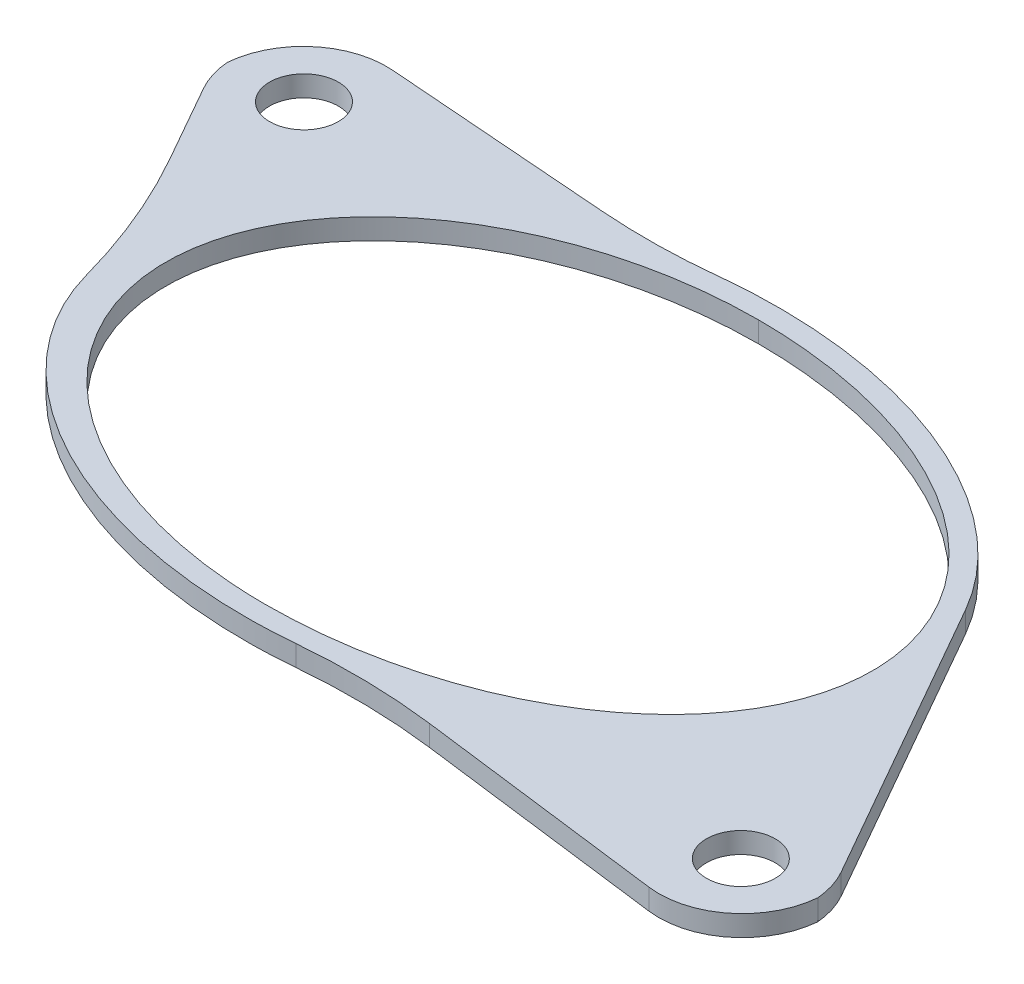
ISO-10303-21;
HEADER;
FILE_DESCRIPTION(('STEP AP214'),'2;1');
FILE_NAME('part.step','',(''),(''),'','','');
FILE_SCHEMA(('AUTOMOTIVE_DESIGN { 1 0 10303 214 1 1 1 1 }'));
ENDSEC;
DATA;
#1=APPLICATION_CONTEXT('core data for automotive mechanical design processes');
#2=APPLICATION_PROTOCOL_DEFINITION('international standard','automotive_design',2000,#1);
#3=PRODUCT_CONTEXT('',#1,'mechanical');
#4=PRODUCT('Part','Part','',(#3));
#5=PRODUCT_RELATED_PRODUCT_CATEGORY('part','',(#4));
#6=PRODUCT_DEFINITION_FORMATION('','',#4);
#7=PRODUCT_DEFINITION_CONTEXT('part definition',#1,'design');
#8=PRODUCT_DEFINITION('design','',#6,#7);
#9=PRODUCT_DEFINITION_SHAPE('','',#8);
#10=(LENGTH_UNIT() NAMED_UNIT(*) SI_UNIT(.MILLI.,.METRE.));
#11=(NAMED_UNIT(*) PLANE_ANGLE_UNIT() SI_UNIT($,.RADIAN.));
#12=(NAMED_UNIT(*) SI_UNIT($,.STERADIAN.) SOLID_ANGLE_UNIT());
#13=UNCERTAINTY_MEASURE_WITH_UNIT(LENGTH_MEASURE(1.E-05),#10,'distance_accuracy_value','');
#14=(GEOMETRIC_REPRESENTATION_CONTEXT(3) GLOBAL_UNCERTAINTY_ASSIGNED_CONTEXT((#13)) GLOBAL_UNIT_ASSIGNED_CONTEXT((#10,
#11,#12)) REPRESENTATION_CONTEXT('',''));
#15=CARTESIAN_POINT('',(0.,0.,0.));
#16=DIRECTION('',(0.,0.,1.));
#17=DIRECTION('',(1.,0.,0.));
#18=AXIS2_PLACEMENT_3D('',#15,#16,#17);
#19=CARTESIAN_POINT('',(0.,1.,0.));
#20=DIRECTION('',(0.,1.,0.));
#21=DIRECTION('',(0.,0.,1.));
#22=AXIS2_PLACEMENT_3D('',#19,#20,#21);
#23=PLANE('',#22);
#24=CARTESIAN_POINT('',(-20.,1.,-10.));
#25=DIRECTION('',(0.,1.,0.));
#26=DIRECTION('',(0.,0.,1.));
#27=AXIS2_PLACEMENT_3D('',#24,#25,#26);
#28=CIRCLE('',#27,1.65);
#29=CARTESIAN_POINT('',(-20.,1.,-8.35));
#30=VERTEX_POINT('',#29);
#31=EDGE_CURVE('E216',#30,#30,#28,.T.);
#32=ORIENTED_EDGE('',*,*,#31,.F.);
#33=EDGE_LOOP('',(#32));
#34=FACE_BOUND('',#33,.T.);
#35=DIRECTION('',(-0.997092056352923,0.,-0.0762065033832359));
#36=VECTOR('',#35,1.);
#37=CARTESIAN_POINT('',(-23.5,1.,-13.7777081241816));
#38=LINE('',#37,#36);
#39=CARTESIAN_POINT('',(-8.28986754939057,1.,-12.6152166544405));
#40=VERTEX_POINT('',#39);
#41=CARTESIAN_POINT('',(-19.1951739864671,1.,-13.4486956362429));
#42=VERTEX_POINT('',#41);
#43=EDGE_CURVE('E325',#40,#42,#38,.T.);
#44=ORIENTED_EDGE('',*,*,#43,.T.);
#45=CARTESIAN_POINT('',(-19.5,1.,-9.46032741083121));
#46=DIRECTION('',(0.,1.,0.));
#47=DIRECTION('',(0.,0.,1.));
#48=AXIS2_PLACEMENT_3D('',#45,#46,#47);
#49=CIRCLE('',#48,4.);
#50=CARTESIAN_POINT('',(-23.4858779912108,1.,-9.79614974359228));
#51=VERTEX_POINT('',#50);
#52=EDGE_CURVE('E58',#42,#51,#49,.T.);
#53=ORIENTED_EDGE('',*,*,#52,.T.);
#54=CARTESIAN_POINT('',(-19.5,1.,-10.1319720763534));
#55=DIRECTION('',(0.,1.,0.));
#56=DIRECTION('',(0.,0.,1.));
#57=AXIS2_PLACEMENT_3D('',#54,#55,#56);
#58=CIRCLE('',#57,4.);
#59=CARTESIAN_POINT('',(-22.9789664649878,1.,-8.15794260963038));
#60=VERTEX_POINT('',#59);
#61=EDGE_CURVE('E276',#51,#60,#58,.T.);
#62=ORIENTED_EDGE('',*,*,#61,.T.);
#63=DIRECTION('',(0.493507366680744,0.,0.869741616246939));
#64=VECTOR('',#63,1.);
#65=CARTESIAN_POINT('',(-23.5,1.,-9.07619546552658));
#66=LINE('',#65,#64);
#67=CARTESIAN_POINT('',(-20.8476714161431,1.,-4.40181630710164));
#68=VERTEX_POINT('',#67);
#69=EDGE_CURVE('E209',#60,#68,#66,.T.);
#70=ORIENTED_EDGE('',*,*,#69,.T.);
#71=CARTESIAN_POINT('',(-46.9399199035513,1.,10.4034046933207));
#72=DIRECTION('',(0.,1.,0.));
#73=DIRECTION('',(0.,0.,1.));
#74=AXIS2_PLACEMENT_3D('',#71,#72,#73);
#75=CIRCLE('',#74,30.);
#76=CARTESIAN_POINT('',(-18.0176815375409,1.,2.4344569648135));
#77=VERTEX_POINT('',#76);
#78=EDGE_CURVE('E252',#68,#77,#75,.F.);
#79=ORIENTED_EDGE('',*,*,#78,.T.);
#80=CARTESIAN_POINT('',(0.,1.,0.));
#81=DIRECTION('',(0.,1.,0.));
#82=DIRECTION('',(-1.,0.,0.));
#83=AXIS2_PLACEMENT_3D('',#80,#81,#82);
#84=ELLIPSE('',#83,18.35,12.85);
#85=CARTESIAN_POINT('',(2.3706659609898,1.,12.7423124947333));
#86=VERTEX_POINT('',#85);
#87=EDGE_CURVE('E203',#77,#86,#84,.T.);
#88=ORIENTED_EDGE('',*,*,#87,.T.);
#89=CARTESIAN_POINT('',(5.09636257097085,1.,42.6182321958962));
#90=DIRECTION('',(0.,1.,0.));
#91=DIRECTION('',(0.,0.,1.));
#92=AXIS2_PLACEMENT_3D('',#89,#90,#91);
#93=CIRCLE('',#92,30.);
#94=CARTESIAN_POINT('',(8.8854424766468,1.,12.8584796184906));
#95=VERTEX_POINT('',#94);
#96=EDGE_CURVE('E260',#86,#95,#93,.F.);
#97=ORIENTED_EDGE('',*,*,#96,.T.);
#98=DIRECTION('',(0.991991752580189,0.,0.126302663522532));
#99=VECTOR('',#98,1.);
#100=CARTESIAN_POINT('',(25.5,1.,14.9738831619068));
#101=LINE('',#100,#99);
#102=CARTESIAN_POINT('',(20.9947893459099,1.,14.4002694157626));
#103=VERTEX_POINT('',#102);
#104=EDGE_CURVE('E208',#95,#103,#101,.T.);
#105=ORIENTED_EDGE('',*,*,#104,.T.);
#106=CARTESIAN_POINT('',(21.5,1.,10.4323024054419));
#107=DIRECTION('',(0.,1.,0.));
#108=DIRECTION('',(0.,0.,1.));
#109=AXIS2_PLACEMENT_3D('',#106,#107,#108);
#110=CIRCLE('',#109,4.);
#111=CARTESIAN_POINT('',(25.4846491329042,1.,10.7824042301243));
#112=VERTEX_POINT('',#111);
#113=EDGE_CURVE('E65',#103,#112,#110,.T.);
#114=ORIENTED_EDGE('',*,*,#113,.T.);
#115=CARTESIAN_POINT('',(21.5,1.,11.1325060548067));
#116=DIRECTION('',(0.,1.,0.));
#117=DIRECTION('',(0.,0.,1.));
#118=AXIS2_PLACEMENT_3D('',#115,#116,#117);
#119=CIRCLE('',#118,4.);
#120=CARTESIAN_POINT('',(24.9750188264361,1.,9.15153554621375));
#121=VERTEX_POINT('',#120);
#122=EDGE_CURVE('E274',#112,#121,#119,.T.);
#123=ORIENTED_EDGE('',*,*,#122,.T.);
#124=DIRECTION('',(-0.495242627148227,0.,-0.868754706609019));
#125=VECTOR('',#124,1.);
#126=CARTESIAN_POINT('',(25.5,1.,10.0724576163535));
#127=LINE('',#126,#125);
#128=CARTESIAN_POINT('',(17.0422586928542,1.,-4.76411372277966));
#129=VERTEX_POINT('',#128);
#130=EDGE_CURVE('E230',#121,#129,#127,.T.);
#131=ORIENTED_EDGE('',*,*,#130,.T.);
#132=CARTESIAN_POINT('',(0.,1.,0.));
#133=DIRECTION('',(0.,1.,0.));
#134=DIRECTION('',(-1.,0.,0.));
#135=AXIS2_PLACEMENT_3D('',#132,#133,#134);
#136=ELLIPSE('',#135,18.35,12.85);
#137=CARTESIAN_POINT('',(-2.79024522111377,1.,-12.700576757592));
#138=VERTEX_POINT('',#137);
#139=EDGE_CURVE('E336',#129,#138,#136,.T.);
#140=ORIENTED_EDGE('',*,*,#139,.T.);
#141=CARTESIAN_POINT('',(-6.0036724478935,1.,-42.5279783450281));
#142=DIRECTION('',(0.,1.,0.));
#143=DIRECTION('',(0.,0.,1.));
#144=AXIS2_PLACEMENT_3D('',#141,#142,#143);
#145=CIRCLE('',#144,30.);
#146=EDGE_CURVE('E256',#138,#40,#145,.F.);
#147=ORIENTED_EDGE('',*,*,#146,.T.);
#148=EDGE_LOOP('',(#44,#53,#62,#70,#79,#88,#97,#105,#114,#123,#131,#140,#147));
#149=FACE_BOUND('',#148,.T.);
#150=CARTESIAN_POINT('',(22.,1.,11.));
#151=DIRECTION('',(0.,1.,0.));
#152=DIRECTION('',(0.,0.,1.));
#153=AXIS2_PLACEMENT_3D('',#150,#151,#152);
#154=CIRCLE('',#153,1.65);
#155=CARTESIAN_POINT('',(22.,1.,12.65));
#156=VERTEX_POINT('',#155);
#157=EDGE_CURVE('E482',#156,#156,#154,.T.);
#158=ORIENTED_EDGE('',*,*,#157,.F.);
#159=EDGE_LOOP('',(#158));
#160=FACE_BOUND('',#159,.T.);
#161=CARTESIAN_POINT('',(0.,1.,0.));
#162=DIRECTION('',(0.,1.,0.));
#163=DIRECTION('',(-1.,0.,0.));
#164=AXIS2_PLACEMENT_3D('',#161,#162,#163);
#165=ELLIPSE('',#164,17.35,11.85);
#166=CARTESIAN_POINT('',(0.,1.,11.85));
#167=VERTEX_POINT('',#166);
#168=CARTESIAN_POINT('',(0.,1.,-11.85));
#169=VERTEX_POINT('',#168);
#170=EDGE_CURVE('E149',#167,#169,#165,.T.);
#171=ORIENTED_EDGE('',*,*,#170,.F.);
#172=CARTESIAN_POINT('',(0.,1.,0.));
#173=DIRECTION('',(0.,1.,0.));
#174=DIRECTION('',(-1.,0.,0.));
#175=AXIS2_PLACEMENT_3D('',#172,#173,#174);
#176=ELLIPSE('',#175,16.65,11.85);
#177=EDGE_CURVE('E159',#169,#167,#176,.T.);
#178=ORIENTED_EDGE('',*,*,#177,.F.);
#179=EDGE_LOOP('',(#171,#178));
#180=FACE_BOUND('',#179,.T.);
#181=ADVANCED_FACE('F41',(#34,#149,#160,#180),#23,.T.);
#182=CARTESIAN_POINT('',(0.,0.,0.));
#183=DIRECTION('',(0.,1.,0.));
#184=DIRECTION('',(0.,0.,1.));
#185=AXIS2_PLACEMENT_3D('',#182,#183,#184);
#186=PLANE('',#185);
#187=CARTESIAN_POINT('',(22.,0.,11.));
#188=DIRECTION('',(0.,1.,0.));
#189=DIRECTION('',(0.,0.,1.));
#190=AXIS2_PLACEMENT_3D('',#187,#188,#189);
#191=CIRCLE('',#190,1.65);
#192=CARTESIAN_POINT('',(22.,0.,12.65));
#193=VERTEX_POINT('',#192);
#194=EDGE_CURVE('E483',#193,#193,#191,.T.);
#195=ORIENTED_EDGE('',*,*,#194,.T.);
#196=EDGE_LOOP('',(#195));
#197=FACE_BOUND('',#196,.T.);
#198=CARTESIAN_POINT('',(-20.,0.,-10.));
#199=DIRECTION('',(0.,1.,0.));
#200=DIRECTION('',(0.,0.,1.));
#201=AXIS2_PLACEMENT_3D('',#198,#199,#200);
#202=CIRCLE('',#201,1.65);
#203=CARTESIAN_POINT('',(-20.,0.,-8.35));
#204=VERTEX_POINT('',#203);
#205=EDGE_CURVE('E342',#204,#204,#202,.T.);
#206=ORIENTED_EDGE('',*,*,#205,.T.);
#207=EDGE_LOOP('',(#206));
#208=FACE_BOUND('',#207,.T.);
#209=CARTESIAN_POINT('',(-19.5,0.,-10.1319720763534));
#210=DIRECTION('',(0.,1.,0.));
#211=DIRECTION('',(0.,0.,1.));
#212=AXIS2_PLACEMENT_3D('',#209,#210,#211);
#213=CIRCLE('',#212,4.);
#214=CARTESIAN_POINT('',(-22.9789664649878,0.,-8.15794260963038));
#215=VERTEX_POINT('',#214);
#216=CARTESIAN_POINT('',(-23.4858779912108,0.,-9.79614974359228));
#217=VERTEX_POINT('',#216);
#218=EDGE_CURVE('E266',#215,#217,#213,.F.);
#219=ORIENTED_EDGE('',*,*,#218,.T.);
#220=CARTESIAN_POINT('',(-19.5,0.,-9.46032741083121));
#221=DIRECTION('',(0.,1.,0.));
#222=DIRECTION('',(0.,0.,1.));
#223=AXIS2_PLACEMENT_3D('',#220,#221,#222);
#224=CIRCLE('',#223,4.);
#225=CARTESIAN_POINT('',(-19.1951739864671,0.,-13.4486956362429));
#226=VERTEX_POINT('',#225);
#227=EDGE_CURVE('E268',#217,#226,#224,.F.);
#228=ORIENTED_EDGE('',*,*,#227,.T.);
#229=DIRECTION('',(-0.997092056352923,0.,-0.0762065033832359));
#230=VECTOR('',#229,1.);
#231=CARTESIAN_POINT('',(-23.5,0.,-13.7777081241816));
#232=LINE('',#231,#230);
#233=CARTESIAN_POINT('',(-8.28986754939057,0.,-12.6152166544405));
#234=VERTEX_POINT('',#233);
#235=EDGE_CURVE('E219',#234,#226,#232,.T.);
#236=ORIENTED_EDGE('',*,*,#235,.F.);
#237=CARTESIAN_POINT('',(-6.0036724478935,0.,-42.5279783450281));
#238=DIRECTION('',(0.,1.,0.));
#239=DIRECTION('',(0.,0.,1.));
#240=AXIS2_PLACEMENT_3D('',#237,#238,#239);
#241=CIRCLE('',#240,30.);
#242=CARTESIAN_POINT('',(-2.79024522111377,0.,-12.700576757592));
#243=VERTEX_POINT('',#242);
#244=EDGE_CURVE('E254',#234,#243,#241,.T.);
#245=ORIENTED_EDGE('',*,*,#244,.T.);
#246=CARTESIAN_POINT('',(0.,0.,0.));
#247=DIRECTION('',(0.,1.,0.));
#248=DIRECTION('',(-1.,0.,0.));
#249=AXIS2_PLACEMENT_3D('',#246,#247,#248);
#250=ELLIPSE('',#249,18.35,12.85);
#251=CARTESIAN_POINT('',(17.0422586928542,0.,-4.76411372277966));
#252=VERTEX_POINT('',#251);
#253=EDGE_CURVE('E215',#252,#243,#250,.T.);
#254=ORIENTED_EDGE('',*,*,#253,.F.);
#255=DIRECTION('',(-0.495242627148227,0.,-0.868754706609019));
#256=VECTOR('',#255,1.);
#257=CARTESIAN_POINT('',(25.5,0.,10.0724576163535));
#258=LINE('',#257,#256);
#259=CARTESIAN_POINT('',(24.9750188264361,0.,9.15153554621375));
#260=VERTEX_POINT('',#259);
#261=EDGE_CURVE('E213',#260,#252,#258,.T.);
#262=ORIENTED_EDGE('',*,*,#261,.F.);
#263=CARTESIAN_POINT('',(21.5,0.,11.1325060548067));
#264=DIRECTION('',(0.,1.,0.));
#265=DIRECTION('',(0.,0.,1.));
#266=AXIS2_PLACEMENT_3D('',#263,#264,#265);
#267=CIRCLE('',#266,4.);
#268=CARTESIAN_POINT('',(25.4846491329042,0.,10.7824042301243));
#269=VERTEX_POINT('',#268);
#270=EDGE_CURVE('E264',#260,#269,#267,.F.);
#271=ORIENTED_EDGE('',*,*,#270,.T.);
#272=CARTESIAN_POINT('',(21.5,0.,10.4323024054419));
#273=DIRECTION('',(0.,1.,0.));
#274=DIRECTION('',(0.,0.,1.));
#275=AXIS2_PLACEMENT_3D('',#272,#273,#274);
#276=CIRCLE('',#275,4.);
#277=CARTESIAN_POINT('',(20.9947893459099,0.,14.4002694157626));
#278=VERTEX_POINT('',#277);
#279=EDGE_CURVE('E262',#269,#278,#276,.F.);
#280=ORIENTED_EDGE('',*,*,#279,.T.);
#281=DIRECTION('',(0.991991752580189,0.,0.126302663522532));
#282=VECTOR('',#281,1.);
#283=CARTESIAN_POINT('',(25.5,0.,14.9738831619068));
#284=LINE('',#283,#282);
#285=CARTESIAN_POINT('',(8.8854424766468,0.,12.8584796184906));
#286=VERTEX_POINT('',#285);
#287=EDGE_CURVE('E227',#286,#278,#284,.T.);
#288=ORIENTED_EDGE('',*,*,#287,.F.);
#289=CARTESIAN_POINT('',(5.09636257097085,0.,42.6182321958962));
#290=DIRECTION('',(0.,1.,0.));
#291=DIRECTION('',(0.,0.,1.));
#292=AXIS2_PLACEMENT_3D('',#289,#290,#291);
#293=CIRCLE('',#292,30.);
#294=CARTESIAN_POINT('',(2.3706659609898,0.,12.7423124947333));
#295=VERTEX_POINT('',#294);
#296=EDGE_CURVE('E258',#286,#295,#293,.T.);
#297=ORIENTED_EDGE('',*,*,#296,.T.);
#298=CARTESIAN_POINT('',(0.,0.,0.));
#299=DIRECTION('',(0.,1.,0.));
#300=DIRECTION('',(-1.,0.,0.));
#301=AXIS2_PLACEMENT_3D('',#298,#299,#300);
#302=ELLIPSE('',#301,18.35,12.85);
#303=CARTESIAN_POINT('',(-18.0176815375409,0.,2.4344569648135));
#304=VERTEX_POINT('',#303);
#305=EDGE_CURVE('E224',#304,#295,#302,.T.);
#306=ORIENTED_EDGE('',*,*,#305,.F.);
#307=CARTESIAN_POINT('',(-46.9399199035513,0.,10.4034046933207));
#308=DIRECTION('',(0.,1.,0.));
#309=DIRECTION('',(0.,0.,1.));
#310=AXIS2_PLACEMENT_3D('',#307,#308,#309);
#311=CIRCLE('',#310,30.);
#312=CARTESIAN_POINT('',(-20.8476714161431,0.,-4.40181630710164));
#313=VERTEX_POINT('',#312);
#314=EDGE_CURVE('E249',#304,#313,#311,.T.);
#315=ORIENTED_EDGE('',*,*,#314,.T.);
#316=DIRECTION('',(0.493507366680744,0.,0.869741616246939));
#317=VECTOR('',#316,1.);
#318=CARTESIAN_POINT('',(-23.5,0.,-9.07619546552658));
#319=LINE('',#318,#317);
#320=EDGE_CURVE('E222',#215,#313,#319,.T.);
#321=ORIENTED_EDGE('',*,*,#320,.F.);
#322=EDGE_LOOP('',(#219,#228,#236,#245,#254,#262,#271,#280,#288,#297,#306,#315,#321));
#323=FACE_BOUND('',#322,.T.);
#324=CARTESIAN_POINT('',(0.,0.,0.));
#325=DIRECTION('',(0.,1.,0.));
#326=DIRECTION('',(-1.,0.,0.));
#327=AXIS2_PLACEMENT_3D('',#324,#325,#326);
#328=ELLIPSE('',#327,16.65,11.85);
#329=CARTESIAN_POINT('',(0.,0.,-11.85));
#330=VERTEX_POINT('',#329);
#331=CARTESIAN_POINT('',(0.,0.,11.85));
#332=VERTEX_POINT('',#331);
#333=EDGE_CURVE('E164',#330,#332,#328,.T.);
#334=ORIENTED_EDGE('',*,*,#333,.T.);
#335=CARTESIAN_POINT('',(0.,0.,0.));
#336=DIRECTION('',(0.,1.,0.));
#337=DIRECTION('',(-1.,0.,0.));
#338=AXIS2_PLACEMENT_3D('',#335,#336,#337);
#339=ELLIPSE('',#338,17.35,11.85);
#340=EDGE_CURVE('E166',#332,#330,#339,.T.);
#341=ORIENTED_EDGE('',*,*,#340,.T.);
#342=EDGE_LOOP('',(#334,#341));
#343=FACE_BOUND('',#342,.T.);
#344=ADVANCED_FACE('F187',(#197,#208,#323,#343),#186,.F.);
#345=CARTESIAN_POINT('',(25.5,1.,10.0724576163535));
#346=DIRECTION('',(-0.868754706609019,0.,0.495242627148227));
#347=DIRECTION('',(0.495242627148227,0.,0.868754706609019));
#348=AXIS2_PLACEMENT_3D('',#345,#346,#347);
#349=PLANE('',#348);
#350=ORIENTED_EDGE('',*,*,#130,.F.);
#351=DIRECTION('',(0.,-1.,0.));
#352=VECTOR('',#351,1.);
#353=CARTESIAN_POINT('',(24.9750188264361,1.,9.15153554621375));
#354=LINE('',#353,#352);
#355=EDGE_CURVE('E50',#121,#260,#354,.T.);
#356=ORIENTED_EDGE('',*,*,#355,.T.);
#357=ORIENTED_EDGE('',*,*,#261,.T.);
#358=DIRECTION('',(0.,-1.,0.));
#359=VECTOR('',#358,1.);
#360=CARTESIAN_POINT('',(17.0422586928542,1.,-4.76411372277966));
#361=LINE('',#360,#359);
#362=EDGE_CURVE('E212',#129,#252,#361,.T.);
#363=ORIENTED_EDGE('',*,*,#362,.F.);
#364=EDGE_LOOP('',(#350,#356,#357,#363));
#365=FACE_BOUND('',#364,.T.);
#366=ADVANCED_FACE('F191',(#365),#349,.F.);
#367=DIRECTION('',(0.,-1.,0.));
#368=VECTOR('',#367,1.);
#369=SURFACE_OF_LINEAR_EXTRUSION('',#136,#368);
#370=ORIENTED_EDGE('',*,*,#253,.T.);
#371=DIRECTION('',(0.,-1.,0.));
#372=VECTOR('',#371,1.);
#373=CARTESIAN_POINT('',(-2.79024522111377,0.,-12.700576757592));
#374=LINE('',#373,#372);
#375=EDGE_CURVE('E244',#243,#138,#374,.F.);
#376=ORIENTED_EDGE('',*,*,#375,.T.);
#377=ORIENTED_EDGE('',*,*,#139,.F.);
#378=ORIENTED_EDGE('',*,*,#362,.T.);
#379=EDGE_LOOP('',(#370,#376,#377,#378));
#380=FACE_BOUND('',#379,.T.);
#381=ADVANCED_FACE('F332',(#380),#369,.F.);
#382=CARTESIAN_POINT('',(-23.5,1.,-13.7777081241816));
#383=DIRECTION('',(-0.0762065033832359,0.,0.997092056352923));
#384=DIRECTION('',(0.997092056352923,0.,0.0762065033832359));
#385=AXIS2_PLACEMENT_3D('',#382,#383,#384);
#386=PLANE('',#385);
#387=ORIENTED_EDGE('',*,*,#235,.T.);
#388=DIRECTION('',(0.,-1.,0.));
#389=VECTOR('',#388,1.);
#390=CARTESIAN_POINT('',(-19.1951739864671,1.,-13.4486956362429));
#391=LINE('',#390,#389);
#392=EDGE_CURVE('E270',#226,#42,#391,.F.);
#393=ORIENTED_EDGE('',*,*,#392,.T.);
#394=ORIENTED_EDGE('',*,*,#43,.F.);
#395=DIRECTION('',(0.,1.,0.));
#396=VECTOR('',#395,1.);
#397=CARTESIAN_POINT('',(-8.28986754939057,0.,-12.6152166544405));
#398=LINE('',#397,#396);
#399=EDGE_CURVE('E241',#40,#234,#398,.F.);
#400=ORIENTED_EDGE('',*,*,#399,.T.);
#401=EDGE_LOOP('',(#387,#393,#394,#400));
#402=FACE_BOUND('',#401,.T.);
#403=ADVANCED_FACE('F322',(#402),#386,.F.);
#404=CARTESIAN_POINT('',(-23.5,1.,-9.07619546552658));
#405=DIRECTION('',(0.869741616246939,0.,-0.493507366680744));
#406=DIRECTION('',(-0.493507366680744,0.,-0.869741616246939));
#407=AXIS2_PLACEMENT_3D('',#404,#405,#406);
#408=PLANE('',#407);
#409=ORIENTED_EDGE('',*,*,#69,.F.);
#410=DIRECTION('',(0.,-1.,0.));
#411=VECTOR('',#410,1.);
#412=CARTESIAN_POINT('',(-22.9789664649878,1.,-8.15794260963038));
#413=LINE('',#412,#411);
#414=EDGE_CURVE('E279',#60,#215,#413,.T.);
#415=ORIENTED_EDGE('',*,*,#414,.T.);
#416=ORIENTED_EDGE('',*,*,#320,.T.);
#417=DIRECTION('',(0.,1.,0.));
#418=VECTOR('',#417,1.);
#419=CARTESIAN_POINT('',(-20.8476714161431,1.,-4.40181630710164));
#420=LINE('',#419,#418);
#421=EDGE_CURVE('E238',#313,#68,#420,.T.);
#422=ORIENTED_EDGE('',*,*,#421,.T.);
#423=EDGE_LOOP('',(#409,#415,#416,#422));
#424=FACE_BOUND('',#423,.T.);
#425=ADVANCED_FACE('F200',(#424),#408,.F.);
#426=DIRECTION('',(0.,-1.,0.));
#427=VECTOR('',#426,1.);
#428=SURFACE_OF_LINEAR_EXTRUSION('',#84,#427);
#429=ORIENTED_EDGE('',*,*,#87,.F.);
#430=DIRECTION('',(0.,-1.,0.));
#431=VECTOR('',#430,1.);
#432=CARTESIAN_POINT('',(-18.0176815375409,1.,2.4344569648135));
#433=LINE('',#432,#431);
#434=EDGE_CURVE('E235',#77,#304,#433,.T.);
#435=ORIENTED_EDGE('',*,*,#434,.T.);
#436=ORIENTED_EDGE('',*,*,#305,.T.);
#437=DIRECTION('',(0.,-1.,0.));
#438=VECTOR('',#437,1.);
#439=CARTESIAN_POINT('',(2.3706659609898,0.,12.7423124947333));
#440=LINE('',#439,#438);
#441=EDGE_CURVE('E233',#295,#86,#440,.F.);
#442=ORIENTED_EDGE('',*,*,#441,.T.);
#443=EDGE_LOOP('',(#429,#435,#436,#442));
#444=FACE_BOUND('',#443,.T.);
#445=ADVANCED_FACE('F195',(#444),#428,.F.);
#446=CARTESIAN_POINT('',(25.5,1.,14.9738831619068));
#447=DIRECTION('',(0.126302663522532,0.,-0.991991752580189));
#448=DIRECTION('',(-0.991991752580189,0.,-0.126302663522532));
#449=AXIS2_PLACEMENT_3D('',#446,#447,#448);
#450=PLANE('',#449);
#451=ORIENTED_EDGE('',*,*,#287,.T.);
#452=DIRECTION('',(0.,-1.,0.));
#453=VECTOR('',#452,1.);
#454=CARTESIAN_POINT('',(20.9947893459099,1.,14.4002694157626));
#455=LINE('',#454,#453);
#456=EDGE_CURVE('E11',#278,#103,#455,.F.);
#457=ORIENTED_EDGE('',*,*,#456,.T.);
#458=ORIENTED_EDGE('',*,*,#104,.F.);
#459=DIRECTION('',(0.,1.,0.));
#460=VECTOR('',#459,1.);
#461=CARTESIAN_POINT('',(8.8854424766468,0.,12.8584796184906));
#462=LINE('',#461,#460);
#463=EDGE_CURVE('E246',#95,#286,#462,.F.);
#464=ORIENTED_EDGE('',*,*,#463,.T.);
#465=EDGE_LOOP('',(#451,#457,#458,#464));
#466=FACE_BOUND('',#465,.T.);
#467=ADVANCED_FACE('F183',(#466),#450,.F.);
#468=CARTESIAN_POINT('',(-20.,1.,-10.));
#469=DIRECTION('',(0.,-1.,0.));
#470=DIRECTION('',(0.,0.,-1.));
#471=AXIS2_PLACEMENT_3D('',#468,#469,#470);
#472=CYLINDRICAL_SURFACE('',#471,1.65);
#473=ORIENTED_EDGE('',*,*,#31,.T.);
#474=EDGE_LOOP('',(#473));
#475=FACE_BOUND('',#474,.T.);
#476=ORIENTED_EDGE('',*,*,#205,.F.);
#477=EDGE_LOOP('',(#476));
#478=FACE_BOUND('',#477,.T.);
#479=ADVANCED_FACE('F179',(#475,#478),#472,.F.);
#480=CARTESIAN_POINT('',(22.,1.,11.));
#481=DIRECTION('',(0.,-1.,0.));
#482=DIRECTION('',(0.,0.,-1.));
#483=AXIS2_PLACEMENT_3D('',#480,#481,#482);
#484=CYLINDRICAL_SURFACE('',#483,1.65);
#485=ORIENTED_EDGE('',*,*,#157,.T.);
#486=EDGE_LOOP('',(#485));
#487=FACE_BOUND('',#486,.T.);
#488=ORIENTED_EDGE('',*,*,#194,.F.);
#489=EDGE_LOOP('',(#488));
#490=FACE_BOUND('',#489,.T.);
#491=ADVANCED_FACE('F176',(#487,#490),#484,.F.);
#492=DIRECTION('',(0.,-1.,0.));
#493=VECTOR('',#492,1.);
#494=SURFACE_OF_LINEAR_EXTRUSION('',#176,#493);
#495=ORIENTED_EDGE('',*,*,#333,.F.);
#496=DIRECTION('',(0.,-1.,0.));
#497=VECTOR('',#496,1.);
#498=CARTESIAN_POINT('',(0.,1.,-11.85));
#499=LINE('',#498,#497);
#500=EDGE_CURVE('E152',#169,#330,#499,.T.);
#501=ORIENTED_EDGE('',*,*,#500,.F.);
#502=ORIENTED_EDGE('',*,*,#177,.T.);
#503=DIRECTION('',(0.,-1.,0.));
#504=VECTOR('',#503,1.);
#505=CARTESIAN_POINT('',(0.,1.,11.85));
#506=LINE('',#505,#504);
#507=EDGE_CURVE('E155',#167,#332,#506,.T.);
#508=ORIENTED_EDGE('',*,*,#507,.T.);
#509=EDGE_LOOP('',(#495,#501,#502,#508));
#510=FACE_BOUND('',#509,.T.);
#511=ADVANCED_FACE('F162',(#510),#494,.T.);
#512=DIRECTION('',(0.,-1.,0.));
#513=VECTOR('',#512,1.);
#514=SURFACE_OF_LINEAR_EXTRUSION('',#165,#513);
#515=ORIENTED_EDGE('',*,*,#340,.F.);
#516=ORIENTED_EDGE('',*,*,#507,.F.);
#517=ORIENTED_EDGE('',*,*,#170,.T.);
#518=ORIENTED_EDGE('',*,*,#500,.T.);
#519=EDGE_LOOP('',(#515,#516,#517,#518));
#520=FACE_BOUND('',#519,.T.);
#521=ADVANCED_FACE('F151',(#520),#514,.T.);
#522=CARTESIAN_POINT('',(-46.9399199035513,0.5,10.4034046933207));
#523=DIRECTION('',(0.,-1.,0.));
#524=DIRECTION('',(0.,0.,-1.));
#525=AXIS2_PLACEMENT_3D('',#522,#523,#524);
#526=CYLINDRICAL_SURFACE('',#525,30.);
#527=ORIENTED_EDGE('',*,*,#78,.F.);
#528=ORIENTED_EDGE('',*,*,#421,.F.);
#529=ORIENTED_EDGE('',*,*,#314,.F.);
#530=ORIENTED_EDGE('',*,*,#434,.F.);
#531=EDGE_LOOP('',(#527,#528,#529,#530));
#532=FACE_BOUND('',#531,.T.);
#533=ADVANCED_FACE('F310',(#532),#526,.F.);
#534=CARTESIAN_POINT('',(-6.0036724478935,0.5,-42.5279783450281));
#535=DIRECTION('',(0.,-1.,0.));
#536=DIRECTION('',(0.,0.,-1.));
#537=AXIS2_PLACEMENT_3D('',#534,#535,#536);
#538=CYLINDRICAL_SURFACE('',#537,30.);
#539=ORIENTED_EDGE('',*,*,#146,.F.);
#540=ORIENTED_EDGE('',*,*,#375,.F.);
#541=ORIENTED_EDGE('',*,*,#244,.F.);
#542=ORIENTED_EDGE('',*,*,#399,.F.);
#543=EDGE_LOOP('',(#539,#540,#541,#542));
#544=FACE_BOUND('',#543,.T.);
#545=ADVANCED_FACE('F328',(#544),#538,.F.);
#546=CARTESIAN_POINT('',(5.09636257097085,0.5,42.6182321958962));
#547=DIRECTION('',(0.,-1.,0.));
#548=DIRECTION('',(0.,0.,-1.));
#549=AXIS2_PLACEMENT_3D('',#546,#547,#548);
#550=CYLINDRICAL_SURFACE('',#549,30.);
#551=ORIENTED_EDGE('',*,*,#96,.F.);
#552=ORIENTED_EDGE('',*,*,#441,.F.);
#553=ORIENTED_EDGE('',*,*,#296,.F.);
#554=ORIENTED_EDGE('',*,*,#463,.F.);
#555=EDGE_LOOP('',(#551,#552,#553,#554));
#556=FACE_BOUND('',#555,.T.);
#557=ADVANCED_FACE('F303',(#556),#550,.F.);
#558=CARTESIAN_POINT('',(-19.5,1.,-10.1319720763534));
#559=DIRECTION('',(0.,-1.,0.));
#560=DIRECTION('',(0.,0.,-1.));
#561=AXIS2_PLACEMENT_3D('',#558,#559,#560);
#562=CYLINDRICAL_SURFACE('',#561,4.);
#563=ORIENTED_EDGE('',*,*,#414,.F.);
#564=ORIENTED_EDGE('',*,*,#61,.F.);
#565=DIRECTION('',(0.,-1.,0.));
#566=VECTOR('',#565,1.);
#567=CARTESIAN_POINT('',(-23.4858779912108,0.5,-9.79614974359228));
#568=LINE('',#567,#566);
#569=EDGE_CURVE('E282',#217,#51,#568,.F.);
#570=ORIENTED_EDGE('',*,*,#569,.F.);
#571=ORIENTED_EDGE('',*,*,#218,.F.);
#572=EDGE_LOOP('',(#563,#564,#570,#571));
#573=FACE_BOUND('',#572,.T.);
#574=ADVANCED_FACE('F317',(#573),#562,.T.);
#575=CARTESIAN_POINT('',(-19.5,1.,-9.46032741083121));
#576=DIRECTION('',(0.,-1.,0.));
#577=DIRECTION('',(0.,0.,-1.));
#578=AXIS2_PLACEMENT_3D('',#575,#576,#577);
#579=CYLINDRICAL_SURFACE('',#578,4.);
#580=ORIENTED_EDGE('',*,*,#52,.F.);
#581=ORIENTED_EDGE('',*,*,#392,.F.);
#582=ORIENTED_EDGE('',*,*,#227,.F.);
#583=ORIENTED_EDGE('',*,*,#569,.T.);
#584=EDGE_LOOP('',(#580,#581,#582,#583));
#585=FACE_BOUND('',#584,.T.);
#586=ADVANCED_FACE('F319',(#585),#579,.T.);
#587=CARTESIAN_POINT('',(21.5,1.,10.4323024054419));
#588=DIRECTION('',(0.,-1.,0.));
#589=DIRECTION('',(0.,0.,-1.));
#590=AXIS2_PLACEMENT_3D('',#587,#588,#589);
#591=CYLINDRICAL_SURFACE('',#590,4.);
#592=DIRECTION('',(0.,-1.,0.));
#593=VECTOR('',#592,1.);
#594=CARTESIAN_POINT('',(25.4846491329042,0.5,10.7824042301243));
#595=LINE('',#594,#593);
#596=EDGE_CURVE('E45',#112,#269,#595,.T.);
#597=ORIENTED_EDGE('',*,*,#596,.F.);
#598=ORIENTED_EDGE('',*,*,#113,.F.);
#599=ORIENTED_EDGE('',*,*,#456,.F.);
#600=ORIENTED_EDGE('',*,*,#279,.F.);
#601=EDGE_LOOP('',(#597,#598,#599,#600));
#602=FACE_BOUND('',#601,.T.);
#603=ADVANCED_FACE('F43',(#602),#591,.T.);
#604=CARTESIAN_POINT('',(21.5,1.,11.1325060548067));
#605=DIRECTION('',(0.,-1.,0.));
#606=DIRECTION('',(0.,0.,-1.));
#607=AXIS2_PLACEMENT_3D('',#604,#605,#606);
#608=CYLINDRICAL_SURFACE('',#607,4.);
#609=ORIENTED_EDGE('',*,*,#122,.F.);
#610=ORIENTED_EDGE('',*,*,#596,.T.);
#611=ORIENTED_EDGE('',*,*,#270,.F.);
#612=ORIENTED_EDGE('',*,*,#355,.F.);
#613=EDGE_LOOP('',(#609,#610,#611,#612));
#614=FACE_BOUND('',#613,.T.);
#615=ADVANCED_FACE('F290',(#614),#608,.T.);
#616=CLOSED_SHELL('',(#181,#344,#366,#381,#403,#425,#445,#467,#479,#491,#511,#521,#533,#545,
#557,#574,#586,#603,#615));
#617=MANIFOLD_SOLID_BREP('B2',#616);
#618=ADVANCED_BREP_SHAPE_REPRESENTATION('',(#18,#617),#14);
#619=SHAPE_DEFINITION_REPRESENTATION(#9,#618);
ENDSEC;
END-ISO-10303-21;
